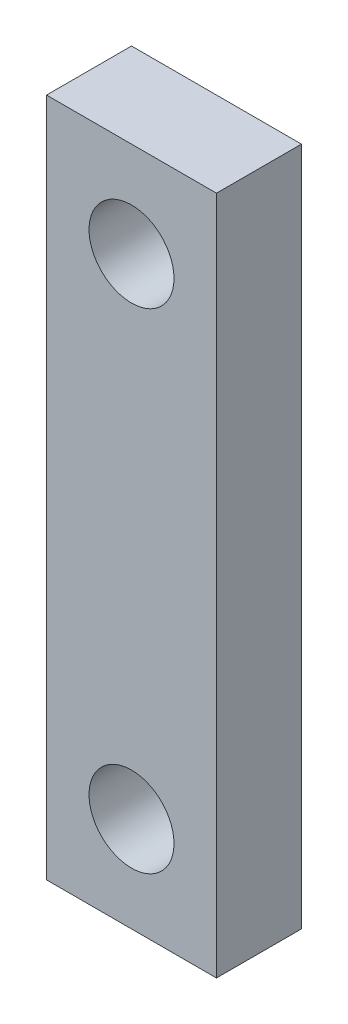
ISO-10303-21;
HEADER;
FILE_DESCRIPTION(('STEP AP214'),'2;1');
FILE_NAME('part.step','',(''),(''),'','','');
FILE_SCHEMA(('AUTOMOTIVE_DESIGN { 1 0 10303 214 1 1 1 1 }'));
ENDSEC;
DATA;
#1=APPLICATION_CONTEXT('core data for automotive mechanical design processes');
#2=APPLICATION_PROTOCOL_DEFINITION('international standard','automotive_design',2000,#1);
#3=PRODUCT_CONTEXT('',#1,'mechanical');
#4=PRODUCT('Part','Part','',(#3));
#5=PRODUCT_RELATED_PRODUCT_CATEGORY('part','',(#4));
#6=PRODUCT_DEFINITION_FORMATION('','',#4);
#7=PRODUCT_DEFINITION_CONTEXT('part definition',#1,'design');
#8=PRODUCT_DEFINITION('design','',#6,#7);
#9=PRODUCT_DEFINITION_SHAPE('','',#8);
#10=(LENGTH_UNIT() NAMED_UNIT(*) SI_UNIT(.MILLI.,.METRE.));
#11=(NAMED_UNIT(*) PLANE_ANGLE_UNIT() SI_UNIT($,.RADIAN.));
#12=(NAMED_UNIT(*) SI_UNIT($,.STERADIAN.) SOLID_ANGLE_UNIT());
#13=UNCERTAINTY_MEASURE_WITH_UNIT(LENGTH_MEASURE(1.E-05),#10,'distance_accuracy_value','');
#14=(GEOMETRIC_REPRESENTATION_CONTEXT(3) GLOBAL_UNCERTAINTY_ASSIGNED_CONTEXT((#13)) GLOBAL_UNIT_ASSIGNED_CONTEXT((#10,
#11,#12)) REPRESENTATION_CONTEXT('',''));
#15=CARTESIAN_POINT('',(0.,0.,0.));
#16=DIRECTION('',(0.,0.,1.));
#17=DIRECTION('',(1.,0.,0.));
#18=AXIS2_PLACEMENT_3D('',#15,#16,#17);
#19=CARTESIAN_POINT('',(1.5875,6.35,1.5875));
#20=DIRECTION('',(-1.,0.,0.));
#21=DIRECTION('',(0.,-1.,0.));
#22=AXIS2_PLACEMENT_3D('',#19,#20,#21);
#23=PLANE('',#22);
#24=DIRECTION('',(0.,1.,0.));
#25=VECTOR('',#24,1.);
#26=CARTESIAN_POINT('',(1.5875,6.35,0.));
#27=LINE('',#26,#25);
#28=CARTESIAN_POINT('',(1.5875,-6.35,0.));
#29=VERTEX_POINT('',#28);
#30=CARTESIAN_POINT('',(1.5875,6.35,0.));
#31=VERTEX_POINT('',#30);
#32=EDGE_CURVE('E96',#29,#31,#27,.T.);
#33=ORIENTED_EDGE('',*,*,#32,.T.);
#34=DIRECTION('',(0.,0.,-1.));
#35=VECTOR('',#34,1.);
#36=CARTESIAN_POINT('',(1.5875,6.35,1.5875));
#37=LINE('',#36,#35);
#38=CARTESIAN_POINT('',(1.5875,6.35,1.5875));
#39=VERTEX_POINT('',#38);
#40=EDGE_CURVE('E11',#39,#31,#37,.T.);
#41=ORIENTED_EDGE('',*,*,#40,.F.);
#42=DIRECTION('',(0.,1.,0.));
#43=VECTOR('',#42,1.);
#44=CARTESIAN_POINT('',(1.5875,6.35,1.5875));
#45=LINE('',#44,#43);
#46=CARTESIAN_POINT('',(1.5875,-6.35,1.5875));
#47=VERTEX_POINT('',#46);
#48=EDGE_CURVE('E84',#47,#39,#45,.T.);
#49=ORIENTED_EDGE('',*,*,#48,.F.);
#50=DIRECTION('',(0.,0.,-1.));
#51=VECTOR('',#50,1.);
#52=CARTESIAN_POINT('',(1.5875,-6.35,1.5875));
#53=LINE('',#52,#51);
#54=EDGE_CURVE('E92',#47,#29,#53,.T.);
#55=ORIENTED_EDGE('',*,*,#54,.T.);
#56=EDGE_LOOP('',(#33,#41,#49,#55));
#57=FACE_BOUND('',#56,.T.);
#58=ADVANCED_FACE('F33',(#57),#23,.F.);
#59=CARTESIAN_POINT('',(-1.5875,6.35,1.5875));
#60=DIRECTION('',(0.,-1.,0.));
#61=DIRECTION('',(0.,0.,-1.));
#62=AXIS2_PLACEMENT_3D('',#59,#60,#61);
#63=PLANE('',#62);
#64=DIRECTION('',(-1.,0.,0.));
#65=VECTOR('',#64,1.);
#66=CARTESIAN_POINT('',(-1.5875,6.35,0.));
#67=LINE('',#66,#65);
#68=CARTESIAN_POINT('',(-1.5875,6.35,0.));
#69=VERTEX_POINT('',#68);
#70=EDGE_CURVE('E88',#31,#69,#67,.T.);
#71=ORIENTED_EDGE('',*,*,#70,.T.);
#72=DIRECTION('',(0.,0.,-1.));
#73=VECTOR('',#72,1.);
#74=CARTESIAN_POINT('',(-1.5875,6.35,1.5875));
#75=LINE('',#74,#73);
#76=CARTESIAN_POINT('',(-1.5875,6.35,1.5875));
#77=VERTEX_POINT('',#76);
#78=EDGE_CURVE('E41',#77,#69,#75,.T.);
#79=ORIENTED_EDGE('',*,*,#78,.F.);
#80=DIRECTION('',(-1.,0.,0.));
#81=VECTOR('',#80,1.);
#82=CARTESIAN_POINT('',(-1.5875,6.35,1.5875));
#83=LINE('',#82,#81);
#84=EDGE_CURVE('E79',#39,#77,#83,.T.);
#85=ORIENTED_EDGE('',*,*,#84,.F.);
#86=ORIENTED_EDGE('',*,*,#40,.T.);
#87=EDGE_LOOP('',(#71,#79,#85,#86));
#88=FACE_BOUND('',#87,.T.);
#89=ADVANCED_FACE('F87',(#88),#63,.F.);
#90=CARTESIAN_POINT('',(-1.5875,6.35,1.5875));
#91=DIRECTION('',(1.,0.,0.));
#92=DIRECTION('',(0.,1.,0.));
#93=AXIS2_PLACEMENT_3D('',#90,#91,#92);
#94=PLANE('',#93);
#95=DIRECTION('',(0.,-1.,0.));
#96=VECTOR('',#95,1.);
#97=CARTESIAN_POINT('',(-1.5875,6.35,0.));
#98=LINE('',#97,#96);
#99=CARTESIAN_POINT('',(-1.5875,-6.35,0.));
#100=VERTEX_POINT('',#99);
#101=EDGE_CURVE('E66',#69,#100,#98,.T.);
#102=ORIENTED_EDGE('',*,*,#101,.T.);
#103=DIRECTION('',(0.,0.,-1.));
#104=VECTOR('',#103,1.);
#105=CARTESIAN_POINT('',(-1.5875,-6.35,1.5875));
#106=LINE('',#105,#104);
#107=CARTESIAN_POINT('',(-1.5875,-6.35,1.5875));
#108=VERTEX_POINT('',#107);
#109=EDGE_CURVE('E89',#108,#100,#106,.T.);
#110=ORIENTED_EDGE('',*,*,#109,.F.);
#111=DIRECTION('',(0.,-1.,0.));
#112=VECTOR('',#111,1.);
#113=CARTESIAN_POINT('',(-1.5875,6.35,1.5875));
#114=LINE('',#113,#112);
#115=EDGE_CURVE('E82',#77,#108,#114,.T.);
#116=ORIENTED_EDGE('',*,*,#115,.F.);
#117=ORIENTED_EDGE('',*,*,#78,.T.);
#118=EDGE_LOOP('',(#102,#110,#116,#117));
#119=FACE_BOUND('',#118,.T.);
#120=ADVANCED_FACE('F90',(#119),#94,.F.);
#121=CARTESIAN_POINT('',(-1.5875,-6.35,1.5875));
#122=DIRECTION('',(0.,1.,0.));
#123=DIRECTION('',(0.,0.,1.));
#124=AXIS2_PLACEMENT_3D('',#121,#122,#123);
#125=PLANE('',#124);
#126=DIRECTION('',(1.,0.,0.));
#127=VECTOR('',#126,1.);
#128=CARTESIAN_POINT('',(-1.5875,-6.35,0.));
#129=LINE('',#128,#127);
#130=EDGE_CURVE('E72',#100,#29,#129,.T.);
#131=ORIENTED_EDGE('',*,*,#130,.T.);
#132=ORIENTED_EDGE('',*,*,#54,.F.);
#133=DIRECTION('',(1.,0.,0.));
#134=VECTOR('',#133,1.);
#135=CARTESIAN_POINT('',(-1.5875,-6.35,1.5875));
#136=LINE('',#135,#134);
#137=EDGE_CURVE('E49',#108,#47,#136,.T.);
#138=ORIENTED_EDGE('',*,*,#137,.F.);
#139=ORIENTED_EDGE('',*,*,#109,.T.);
#140=EDGE_LOOP('',(#131,#132,#138,#139));
#141=FACE_BOUND('',#140,.T.);
#142=ADVANCED_FACE('F104',(#141),#125,.F.);
#143=CARTESIAN_POINT('',(0.,0.,1.5875));
#144=DIRECTION('',(0.,0.,1.));
#145=DIRECTION('',(1.,0.,0.));
#146=AXIS2_PLACEMENT_3D('',#143,#144,#145);
#147=PLANE('',#146);
#148=CARTESIAN_POINT('',(0.,4.572,1.5875));
#149=DIRECTION('',(0.,0.,1.));
#150=DIRECTION('',(1.,0.,0.));
#151=AXIS2_PLACEMENT_3D('',#148,#149,#150);
#152=CIRCLE('',#151,0.793750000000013);
#153=CARTESIAN_POINT('',(0.793750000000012,4.572,1.5875));
#154=VERTEX_POINT('',#153);
#155=EDGE_CURVE('E116',#154,#154,#152,.T.);
#156=ORIENTED_EDGE('',*,*,#155,.F.);
#157=EDGE_LOOP('',(#156));
#158=FACE_BOUND('',#157,.T.);
#159=CARTESIAN_POINT('',(0.,-4.572,1.5875));
#160=DIRECTION('',(0.,0.,1.));
#161=DIRECTION('',(1.,0.,0.));
#162=AXIS2_PLACEMENT_3D('',#159,#160,#161);
#163=CIRCLE('',#162,0.793750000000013);
#164=CARTESIAN_POINT('',(0.793750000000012,-4.572,1.5875));
#165=VERTEX_POINT('',#164);
#166=EDGE_CURVE('E110',#165,#165,#163,.T.);
#167=ORIENTED_EDGE('',*,*,#166,.F.);
#168=EDGE_LOOP('',(#167));
#169=FACE_BOUND('',#168,.T.);
#170=ORIENTED_EDGE('',*,*,#48,.T.);
#171=ORIENTED_EDGE('',*,*,#84,.T.);
#172=ORIENTED_EDGE('',*,*,#115,.T.);
#173=ORIENTED_EDGE('',*,*,#137,.T.);
#174=EDGE_LOOP('',(#170,#171,#172,#173));
#175=FACE_BOUND('',#174,.T.);
#176=ADVANCED_FACE('F80',(#158,#169,#175),#147,.T.);
#177=CARTESIAN_POINT('',(0.,0.,0.));
#178=DIRECTION('',(0.,0.,1.));
#179=DIRECTION('',(1.,0.,0.));
#180=AXIS2_PLACEMENT_3D('',#177,#178,#179);
#181=PLANE('',#180);
#182=CARTESIAN_POINT('',(0.,4.572,0.));
#183=DIRECTION('',(0.,0.,1.));
#184=DIRECTION('',(1.,0.,0.));
#185=AXIS2_PLACEMENT_3D('',#182,#183,#184);
#186=CIRCLE('',#185,0.793750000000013);
#187=CARTESIAN_POINT('',(0.793750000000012,4.572,0.));
#188=VERTEX_POINT('',#187);
#189=EDGE_CURVE('E99',#188,#188,#186,.T.);
#190=ORIENTED_EDGE('',*,*,#189,.T.);
#191=EDGE_LOOP('',(#190));
#192=FACE_BOUND('',#191,.T.);
#193=CARTESIAN_POINT('',(0.,-4.572,0.));
#194=DIRECTION('',(0.,0.,1.));
#195=DIRECTION('',(1.,0.,0.));
#196=AXIS2_PLACEMENT_3D('',#193,#194,#195);
#197=CIRCLE('',#196,0.793750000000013);
#198=CARTESIAN_POINT('',(0.793750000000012,-4.572,0.));
#199=VERTEX_POINT('',#198);
#200=EDGE_CURVE('E113',#199,#199,#197,.T.);
#201=ORIENTED_EDGE('',*,*,#200,.T.);
#202=EDGE_LOOP('',(#201));
#203=FACE_BOUND('',#202,.T.);
#204=ORIENTED_EDGE('',*,*,#32,.F.);
#205=ORIENTED_EDGE('',*,*,#130,.F.);
#206=ORIENTED_EDGE('',*,*,#101,.F.);
#207=ORIENTED_EDGE('',*,*,#70,.F.);
#208=EDGE_LOOP('',(#204,#205,#206,#207));
#209=FACE_BOUND('',#208,.T.);
#210=ADVANCED_FACE('F107',(#192,#203,#209),#181,.F.);
#211=CARTESIAN_POINT('',(0.,-4.572,0.));
#212=DIRECTION('',(0.,0.,1.));
#213=DIRECTION('',(1.,0.,0.));
#214=AXIS2_PLACEMENT_3D('',#211,#212,#213);
#215=CYLINDRICAL_SURFACE('',#214,0.793750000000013);
#216=ORIENTED_EDGE('',*,*,#200,.F.);
#217=EDGE_LOOP('',(#216));
#218=FACE_BOUND('',#217,.T.);
#219=ORIENTED_EDGE('',*,*,#166,.T.);
#220=EDGE_LOOP('',(#219));
#221=FACE_BOUND('',#220,.T.);
#222=ADVANCED_FACE('F127',(#218,#221),#215,.F.);
#223=CARTESIAN_POINT('',(0.,4.572,0.));
#224=DIRECTION('',(0.,0.,1.));
#225=DIRECTION('',(1.,0.,0.));
#226=AXIS2_PLACEMENT_3D('',#223,#224,#225);
#227=CYLINDRICAL_SURFACE('',#226,0.793750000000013);
#228=ORIENTED_EDGE('',*,*,#189,.F.);
#229=EDGE_LOOP('',(#228));
#230=FACE_BOUND('',#229,.T.);
#231=ORIENTED_EDGE('',*,*,#155,.T.);
#232=EDGE_LOOP('',(#231));
#233=FACE_BOUND('',#232,.T.);
#234=ADVANCED_FACE('F124',(#230,#233),#227,.F.);
#235=CLOSED_SHELL('',(#58,#89,#120,#142,#176,#210,#222,#234));
#236=MANIFOLD_SOLID_BREP('B2',#235);
#237=ADVANCED_BREP_SHAPE_REPRESENTATION('',(#18,#236),#14);
#238=SHAPE_DEFINITION_REPRESENTATION(#9,#237);
ENDSEC;
END-ISO-10303-21;
